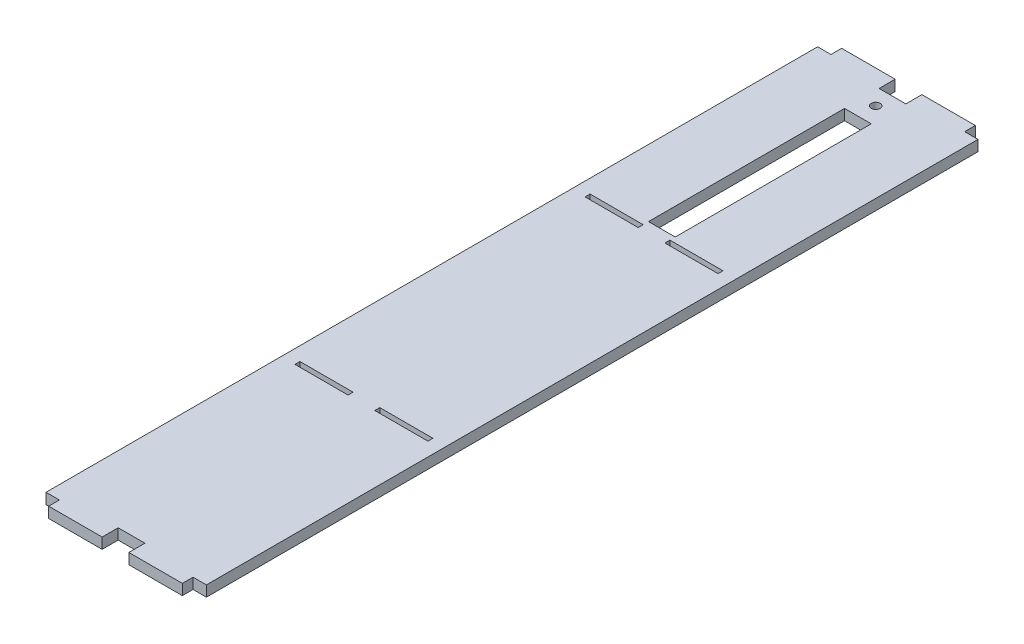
from build123d import *

# Parameters (mm, degrees)
CROQUIS1_R              = 2.5
CROQUIS1_W              = 29.8
CROQUIS1_H              = 2.8
CROQUIS1_W_2            = 15
CROQUIS1_H_2            = 110
SALIENTE_EXTRUIR1_DEPTH = 6


with BuildPart() as part:
    # Croquis1 → Saliente-Extruir1 (new body)
    with BuildSketch(Plane(origin=(0, 0, 0), x_dir=(1, 0, 0), z_dir=(0, 1, 0))):
        Polygon((0, 0), (7.5, 0), (7.5, -6), (37.5, -6), (37.5, 0), (37.5, 3), (52.5, 3), (52.5, 0), (52.5, -6), (82.5, -6), (82.5, 0), (90, 0), (90, 433), (82.5, 433), (82.5, 439), (52.5, 439), (52.5, 433), (52.5, 430), (37.5, 430), (37.5, 433), (37.5, 439), (7.5, 439), (7.5, 433), (0, 433), align=None)
        with Locations(Location((45, 420.6, 0), (0, 0, 270))):
            Circle(CROQUIS1_R, mode=Mode.SUBTRACT)
        with Locations((22.6, 133.4)):
            Rectangle(CROQUIS1_W, CROQUIS1_H, mode=Mode.SUBTRACT)
        with Locations((67.4, 133.4)):
            Rectangle(CROQUIS1_W, CROQUIS1_H, mode=Mode.SUBTRACT)
        with Locations((67.4, 296.2)):
            Rectangle(CROQUIS1_W, CROQUIS1_H, mode=Mode.SUBTRACT)
        with Locations((22.6, 296.2)):
            Rectangle(CROQUIS1_W, CROQUIS1_H, mode=Mode.SUBTRACT)
        with Locations((45, 355.6)):
            Rectangle(CROQUIS1_W_2, CROQUIS1_H_2, mode=Mode.SUBTRACT)
    extrude(amount=SALIENTE_EXTRUIR1_DEPTH)


solid = part.part
